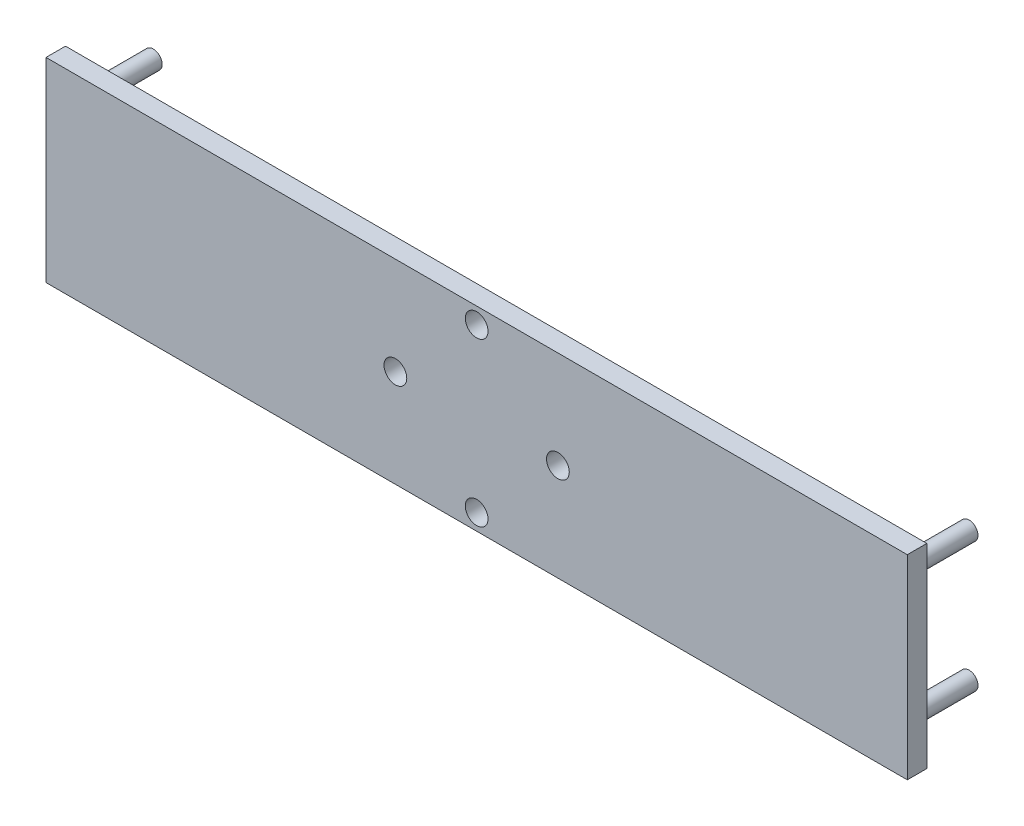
ISO-10303-21;
HEADER;
FILE_DESCRIPTION(('STEP AP214'),'2;1');
FILE_NAME('part.step','',(''),(''),'','','');
FILE_SCHEMA(('AUTOMOTIVE_DESIGN { 1 0 10303 214 1 1 1 1 }'));
ENDSEC;
DATA;
#1=APPLICATION_CONTEXT('core data for automotive mechanical design processes');
#2=APPLICATION_PROTOCOL_DEFINITION('international standard','automotive_design',2000,#1);
#3=PRODUCT_CONTEXT('',#1,'mechanical');
#4=PRODUCT('Part','Part','',(#3));
#5=PRODUCT_RELATED_PRODUCT_CATEGORY('part','',(#4));
#6=PRODUCT_DEFINITION_FORMATION('','',#4);
#7=PRODUCT_DEFINITION_CONTEXT('part definition',#1,'design');
#8=PRODUCT_DEFINITION('design','',#6,#7);
#9=PRODUCT_DEFINITION_SHAPE('','',#8);
#10=(LENGTH_UNIT() NAMED_UNIT(*) SI_UNIT(.MILLI.,.METRE.));
#11=(NAMED_UNIT(*) PLANE_ANGLE_UNIT() SI_UNIT($,.RADIAN.));
#12=(NAMED_UNIT(*) SI_UNIT($,.STERADIAN.) SOLID_ANGLE_UNIT());
#13=UNCERTAINTY_MEASURE_WITH_UNIT(LENGTH_MEASURE(1.E-05),#10,'distance_accuracy_value','');
#14=(GEOMETRIC_REPRESENTATION_CONTEXT(3) GLOBAL_UNCERTAINTY_ASSIGNED_CONTEXT((#13)) GLOBAL_UNIT_ASSIGNED_CONTEXT((#10,
#11,#12)) REPRESENTATION_CONTEXT('',''));
#15=CARTESIAN_POINT('',(0.,0.,0.));
#16=DIRECTION('',(0.,0.,1.));
#17=DIRECTION('',(1.,0.,0.));
#18=AXIS2_PLACEMENT_3D('',#15,#16,#17);
#19=CARTESIAN_POINT('',(132.5,0.,6.));
#20=DIRECTION('',(1.,0.,0.));
#21=DIRECTION('',(0.,0.,-1.));
#22=AXIS2_PLACEMENT_3D('',#19,#20,#21);
#23=PLANE('',#22);
#24=DIRECTION('',(0.,-1.,0.));
#25=VECTOR('',#24,1.);
#26=CARTESIAN_POINT('',(132.5,0.,0.));
#27=LINE('',#26,#25);
#28=CARTESIAN_POINT('',(132.5,30.,0.));
#29=VERTEX_POINT('',#28);
#30=CARTESIAN_POINT('',(132.5,-30.,0.));
#31=VERTEX_POINT('',#30);
#32=EDGE_CURVE('E117',#29,#31,#27,.T.);
#33=ORIENTED_EDGE('',*,*,#32,.F.);
#34=DIRECTION('',(0.,0.,-1.));
#35=VECTOR('',#34,1.);
#36=CARTESIAN_POINT('',(132.5,30.,6.));
#37=LINE('',#36,#35);
#38=CARTESIAN_POINT('',(132.5,30.,6.));
#39=VERTEX_POINT('',#38);
#40=EDGE_CURVE('E76',#39,#29,#37,.T.);
#41=ORIENTED_EDGE('',*,*,#40,.F.);
#42=DIRECTION('',(0.,-1.,0.));
#43=VECTOR('',#42,1.);
#44=CARTESIAN_POINT('',(132.5,0.,6.));
#45=LINE('',#44,#43);
#46=CARTESIAN_POINT('',(132.5,-30.,6.));
#47=VERTEX_POINT('',#46);
#48=EDGE_CURVE('E97',#39,#47,#45,.T.);
#49=ORIENTED_EDGE('',*,*,#48,.T.);
#50=DIRECTION('',(0.,0.,-1.));
#51=VECTOR('',#50,1.);
#52=CARTESIAN_POINT('',(132.5,-30.,6.));
#53=LINE('',#52,#51);
#54=EDGE_CURVE('E73',#47,#31,#53,.T.);
#55=ORIENTED_EDGE('',*,*,#54,.T.);
#56=EDGE_LOOP('',(#33,#41,#49,#55));
#57=FACE_BOUND('',#56,.T.);
#58=ADVANCED_FACE('F32',(#57),#23,.T.);
#59=CARTESIAN_POINT('',(0.,30.,6.));
#60=DIRECTION('',(0.,1.,0.));
#61=DIRECTION('',(0.,0.,1.));
#62=AXIS2_PLACEMENT_3D('',#59,#60,#61);
#63=PLANE('',#62);
#64=DIRECTION('',(1.,0.,0.));
#65=VECTOR('',#64,1.);
#66=CARTESIAN_POINT('',(0.,30.,0.));
#67=LINE('',#66,#65);
#68=CARTESIAN_POINT('',(-132.5,30.,0.));
#69=VERTEX_POINT('',#68);
#70=EDGE_CURVE('E87',#69,#29,#67,.T.);
#71=ORIENTED_EDGE('',*,*,#70,.F.);
#72=DIRECTION('',(0.,0.,-1.));
#73=VECTOR('',#72,1.);
#74=CARTESIAN_POINT('',(-132.5,30.,6.));
#75=LINE('',#74,#73);
#76=CARTESIAN_POINT('',(-132.5,30.,6.));
#77=VERTEX_POINT('',#76);
#78=EDGE_CURVE('E81',#77,#69,#75,.T.);
#79=ORIENTED_EDGE('',*,*,#78,.F.);
#80=DIRECTION('',(1.,0.,0.));
#81=VECTOR('',#80,1.);
#82=CARTESIAN_POINT('',(0.,30.,6.));
#83=LINE('',#82,#81);
#84=EDGE_CURVE('E85',#77,#39,#83,.T.);
#85=ORIENTED_EDGE('',*,*,#84,.T.);
#86=ORIENTED_EDGE('',*,*,#40,.T.);
#87=EDGE_LOOP('',(#71,#79,#85,#86));
#88=FACE_BOUND('',#87,.T.);
#89=ADVANCED_FACE('F83',(#88),#63,.T.);
#90=CARTESIAN_POINT('',(-132.5,0.,6.));
#91=DIRECTION('',(1.,0.,0.));
#92=DIRECTION('',(0.,0.,-1.));
#93=AXIS2_PLACEMENT_3D('',#90,#91,#92);
#94=PLANE('',#93);
#95=DIRECTION('',(0.,-1.,0.));
#96=VECTOR('',#95,1.);
#97=CARTESIAN_POINT('',(-132.5,0.,0.));
#98=LINE('',#97,#96);
#99=CARTESIAN_POINT('',(-132.5,-30.,0.));
#100=VERTEX_POINT('',#99);
#101=EDGE_CURVE('E120',#69,#100,#98,.T.);
#102=ORIENTED_EDGE('',*,*,#101,.T.);
#103=DIRECTION('',(0.,0.,-1.));
#104=VECTOR('',#103,1.);
#105=CARTESIAN_POINT('',(-132.5,-30.,6.));
#106=LINE('',#105,#104);
#107=CARTESIAN_POINT('',(-132.5,-30.,6.));
#108=VERTEX_POINT('',#107);
#109=EDGE_CURVE('E90',#108,#100,#106,.T.);
#110=ORIENTED_EDGE('',*,*,#109,.F.);
#111=DIRECTION('',(0.,-1.,0.));
#112=VECTOR('',#111,1.);
#113=CARTESIAN_POINT('',(-132.5,0.,6.));
#114=LINE('',#113,#112);
#115=EDGE_CURVE('E93',#77,#108,#114,.T.);
#116=ORIENTED_EDGE('',*,*,#115,.F.);
#117=ORIENTED_EDGE('',*,*,#78,.T.);
#118=EDGE_LOOP('',(#102,#110,#116,#117));
#119=FACE_BOUND('',#118,.T.);
#120=ADVANCED_FACE('F94',(#119),#94,.F.);
#121=CARTESIAN_POINT('',(0.,25.,6.));
#122=DIRECTION('',(0.,0.,-1.));
#123=DIRECTION('',(-1.,0.,0.));
#124=AXIS2_PLACEMENT_3D('',#121,#122,#123);
#125=CYLINDRICAL_SURFACE('',#124,3.5);
#126=CARTESIAN_POINT('',(0.,25.,6.));
#127=DIRECTION('',(0.,0.,1.));
#128=DIRECTION('',(1.,0.,0.));
#129=AXIS2_PLACEMENT_3D('',#126,#127,#128);
#130=CIRCLE('',#129,3.5);
#131=CARTESIAN_POINT('',(3.5,25.,6.));
#132=VERTEX_POINT('',#131);
#133=EDGE_CURVE('E99',#132,#132,#130,.T.);
#134=ORIENTED_EDGE('',*,*,#133,.T.);
#135=EDGE_LOOP('',(#134));
#136=FACE_BOUND('',#135,.T.);
#137=CARTESIAN_POINT('',(0.,25.,0.));
#138=DIRECTION('',(0.,0.,1.));
#139=DIRECTION('',(1.,0.,0.));
#140=AXIS2_PLACEMENT_3D('',#137,#138,#139);
#141=CIRCLE('',#140,3.5);
#142=CARTESIAN_POINT('',(3.5,25.,0.));
#143=VERTEX_POINT('',#142);
#144=EDGE_CURVE('E114',#143,#143,#141,.T.);
#145=ORIENTED_EDGE('',*,*,#144,.F.);
#146=EDGE_LOOP('',(#145));
#147=FACE_BOUND('',#146,.T.);
#148=ADVANCED_FACE('F160',(#136,#147),#125,.F.);
#149=CARTESIAN_POINT('',(25.,0.,6.));
#150=DIRECTION('',(0.,0.,-1.));
#151=DIRECTION('',(-1.,0.,0.));
#152=AXIS2_PLACEMENT_3D('',#149,#150,#151);
#153=CYLINDRICAL_SURFACE('',#152,3.5);
#154=CARTESIAN_POINT('',(25.,0.,6.));
#155=DIRECTION('',(0.,0.,1.));
#156=DIRECTION('',(1.,0.,0.));
#157=AXIS2_PLACEMENT_3D('',#154,#155,#156);
#158=CIRCLE('',#157,3.5);
#159=CARTESIAN_POINT('',(28.5,0.,6.));
#160=VERTEX_POINT('',#159);
#161=EDGE_CURVE('E180',#160,#160,#158,.T.);
#162=ORIENTED_EDGE('',*,*,#161,.T.);
#163=EDGE_LOOP('',(#162));
#164=FACE_BOUND('',#163,.T.);
#165=CARTESIAN_POINT('',(25.,0.,0.));
#166=DIRECTION('',(0.,0.,1.));
#167=DIRECTION('',(1.,0.,0.));
#168=AXIS2_PLACEMENT_3D('',#165,#166,#167);
#169=CIRCLE('',#168,3.5);
#170=CARTESIAN_POINT('',(28.5,0.,0.));
#171=VERTEX_POINT('',#170);
#172=EDGE_CURVE('E111',#171,#171,#169,.T.);
#173=ORIENTED_EDGE('',*,*,#172,.F.);
#174=EDGE_LOOP('',(#173));
#175=FACE_BOUND('',#174,.T.);
#176=ADVANCED_FACE('F163',(#164,#175),#153,.F.);
#177=CARTESIAN_POINT('',(-1.74574066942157E-13,-25.,6.));
#178=DIRECTION('',(0.,0.,-1.));
#179=DIRECTION('',(-1.,0.,0.));
#180=AXIS2_PLACEMENT_3D('',#177,#178,#179);
#181=CYLINDRICAL_SURFACE('',#180,3.5);
#182=CARTESIAN_POINT('',(-1.74574066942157E-13,-25.,6.));
#183=DIRECTION('',(0.,0.,1.));
#184=DIRECTION('',(1.,0.,0.));
#185=AXIS2_PLACEMENT_3D('',#182,#183,#184);
#186=CIRCLE('',#185,3.5);
#187=CARTESIAN_POINT('',(3.49999999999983,-25.,6.));
#188=VERTEX_POINT('',#187);
#189=EDGE_CURVE('E178',#188,#188,#186,.T.);
#190=ORIENTED_EDGE('',*,*,#189,.T.);
#191=EDGE_LOOP('',(#190));
#192=FACE_BOUND('',#191,.T.);
#193=CARTESIAN_POINT('',(-1.74574066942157E-13,-25.,0.));
#194=DIRECTION('',(0.,0.,1.));
#195=DIRECTION('',(1.,0.,0.));
#196=AXIS2_PLACEMENT_3D('',#193,#194,#195);
#197=CIRCLE('',#196,3.5);
#198=CARTESIAN_POINT('',(3.49999999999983,-25.,0.));
#199=VERTEX_POINT('',#198);
#200=EDGE_CURVE('E107',#199,#199,#197,.T.);
#201=ORIENTED_EDGE('',*,*,#200,.F.);
#202=EDGE_LOOP('',(#201));
#203=FACE_BOUND('',#202,.T.);
#204=ADVANCED_FACE('F166',(#192,#203),#181,.F.);
#205=CARTESIAN_POINT('',(-25.,2.61861100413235E-13,6.));
#206=DIRECTION('',(0.,0.,-1.));
#207=DIRECTION('',(-1.,0.,0.));
#208=AXIS2_PLACEMENT_3D('',#205,#206,#207);
#209=CYLINDRICAL_SURFACE('',#208,3.5);
#210=CARTESIAN_POINT('',(-25.,2.61861100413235E-13,6.));
#211=DIRECTION('',(0.,0.,1.));
#212=DIRECTION('',(1.,0.,0.));
#213=AXIS2_PLACEMENT_3D('',#210,#211,#212);
#214=CIRCLE('',#213,3.5);
#215=CARTESIAN_POINT('',(-21.5,2.61861100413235E-13,6.));
#216=VERTEX_POINT('',#215);
#217=EDGE_CURVE('E123',#216,#216,#214,.T.);
#218=ORIENTED_EDGE('',*,*,#217,.T.);
#219=EDGE_LOOP('',(#218));
#220=FACE_BOUND('',#219,.T.);
#221=CARTESIAN_POINT('',(-25.,2.61861100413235E-13,0.));
#222=DIRECTION('',(0.,0.,1.));
#223=DIRECTION('',(1.,0.,0.));
#224=AXIS2_PLACEMENT_3D('',#221,#222,#223);
#225=CIRCLE('',#224,3.5);
#226=CARTESIAN_POINT('',(-21.5,2.61861100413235E-13,0.));
#227=VERTEX_POINT('',#226);
#228=EDGE_CURVE('E104',#227,#227,#225,.T.);
#229=ORIENTED_EDGE('',*,*,#228,.F.);
#230=EDGE_LOOP('',(#229));
#231=FACE_BOUND('',#230,.T.);
#232=ADVANCED_FACE('F34',(#220,#231),#209,.F.);
#233=CARTESIAN_POINT('',(0.,-30.,6.));
#234=DIRECTION('',(0.,1.,0.));
#235=DIRECTION('',(0.,0.,1.));
#236=AXIS2_PLACEMENT_3D('',#233,#234,#235);
#237=PLANE('',#236);
#238=DIRECTION('',(1.,0.,0.));
#239=VECTOR('',#238,1.);
#240=CARTESIAN_POINT('',(0.,-30.,0.));
#241=LINE('',#240,#239);
#242=EDGE_CURVE('E66',#100,#31,#241,.T.);
#243=ORIENTED_EDGE('',*,*,#242,.T.);
#244=ORIENTED_EDGE('',*,*,#54,.F.);
#245=DIRECTION('',(1.,0.,0.));
#246=VECTOR('',#245,1.);
#247=CARTESIAN_POINT('',(0.,-30.,6.));
#248=LINE('',#247,#246);
#249=EDGE_CURVE('E49',#108,#47,#248,.T.);
#250=ORIENTED_EDGE('',*,*,#249,.F.);
#251=ORIENTED_EDGE('',*,*,#109,.T.);
#252=EDGE_LOOP('',(#243,#244,#250,#251));
#253=FACE_BOUND('',#252,.T.);
#254=ADVANCED_FACE('F173',(#253),#237,.F.);
#255=CARTESIAN_POINT('',(0.,0.,6.));
#256=DIRECTION('',(0.,0.,1.));
#257=DIRECTION('',(1.,0.,0.));
#258=AXIS2_PLACEMENT_3D('',#255,#256,#257);
#259=PLANE('',#258);
#260=ORIENTED_EDGE('',*,*,#217,.F.);
#261=EDGE_LOOP('',(#260));
#262=FACE_BOUND('',#261,.T.);
#263=ORIENTED_EDGE('',*,*,#189,.F.);
#264=EDGE_LOOP('',(#263));
#265=FACE_BOUND('',#264,.T.);
#266=ORIENTED_EDGE('',*,*,#161,.F.);
#267=EDGE_LOOP('',(#266));
#268=FACE_BOUND('',#267,.T.);
#269=ORIENTED_EDGE('',*,*,#133,.F.);
#270=EDGE_LOOP('',(#269));
#271=FACE_BOUND('',#270,.T.);
#272=ORIENTED_EDGE('',*,*,#48,.F.);
#273=ORIENTED_EDGE('',*,*,#84,.F.);
#274=ORIENTED_EDGE('',*,*,#115,.T.);
#275=ORIENTED_EDGE('',*,*,#249,.T.);
#276=EDGE_LOOP('',(#272,#273,#274,#275));
#277=FACE_BOUND('',#276,.T.);
#278=ADVANCED_FACE('F96',(#262,#265,#268,#271,#277),#259,.T.);
#279=CARTESIAN_POINT('',(0.,0.,0.));
#280=DIRECTION('',(0.,0.,1.));
#281=DIRECTION('',(1.,0.,0.));
#282=AXIS2_PLACEMENT_3D('',#279,#280,#281);
#283=PLANE('',#282);
#284=CARTESIAN_POINT('',(-125.5,-20.,0.));
#285=DIRECTION('',(0.,0.,1.));
#286=DIRECTION('',(1.,0.,0.));
#287=AXIS2_PLACEMENT_3D('',#284,#285,#286);
#288=CIRCLE('',#287,2.75000000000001);
#289=CARTESIAN_POINT('',(-122.75,-20.,0.));
#290=VERTEX_POINT('',#289);
#291=EDGE_CURVE('E11',#290,#290,#288,.F.);
#292=ORIENTED_EDGE('',*,*,#291,.F.);
#293=EDGE_LOOP('',(#292));
#294=FACE_BOUND('',#293,.T.);
#295=CARTESIAN_POINT('',(125.5,20.0000000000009,0.));
#296=DIRECTION('',(0.,0.,1.));
#297=DIRECTION('',(1.,0.,0.));
#298=AXIS2_PLACEMENT_3D('',#295,#296,#297);
#299=CIRCLE('',#298,2.75000000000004);
#300=CARTESIAN_POINT('',(128.25,20.0000000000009,0.));
#301=VERTEX_POINT('',#300);
#302=EDGE_CURVE('E41',#301,#301,#299,.F.);
#303=ORIENTED_EDGE('',*,*,#302,.F.);
#304=EDGE_LOOP('',(#303));
#305=FACE_BOUND('',#304,.T.);
#306=CARTESIAN_POINT('',(-125.5,20.,0.));
#307=DIRECTION('',(0.,0.,1.));
#308=DIRECTION('',(1.,0.,0.));
#309=AXIS2_PLACEMENT_3D('',#306,#307,#308);
#310=CIRCLE('',#309,2.75000000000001);
#311=CARTESIAN_POINT('',(-122.75,20.,0.));
#312=VERTEX_POINT('',#311);
#313=EDGE_CURVE('E140',#312,#312,#310,.T.);
#314=ORIENTED_EDGE('',*,*,#313,.T.);
#315=EDGE_LOOP('',(#314));
#316=FACE_BOUND('',#315,.T.);
#317=CARTESIAN_POINT('',(125.5,-19.9999999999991,0.));
#318=DIRECTION('',(0.,0.,1.));
#319=DIRECTION('',(1.,0.,0.));
#320=AXIS2_PLACEMENT_3D('',#317,#318,#319);
#321=CIRCLE('',#320,2.75000000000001);
#322=CARTESIAN_POINT('',(128.25,-19.9999999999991,0.));
#323=VERTEX_POINT('',#322);
#324=EDGE_CURVE('E144',#323,#323,#321,.T.);
#325=ORIENTED_EDGE('',*,*,#324,.T.);
#326=EDGE_LOOP('',(#325));
#327=FACE_BOUND('',#326,.T.);
#328=ORIENTED_EDGE('',*,*,#228,.T.);
#329=EDGE_LOOP('',(#328));
#330=FACE_BOUND('',#329,.T.);
#331=ORIENTED_EDGE('',*,*,#200,.T.);
#332=EDGE_LOOP('',(#331));
#333=FACE_BOUND('',#332,.T.);
#334=ORIENTED_EDGE('',*,*,#172,.T.);
#335=EDGE_LOOP('',(#334));
#336=FACE_BOUND('',#335,.T.);
#337=ORIENTED_EDGE('',*,*,#144,.T.);
#338=EDGE_LOOP('',(#337));
#339=FACE_BOUND('',#338,.T.);
#340=ORIENTED_EDGE('',*,*,#32,.T.);
#341=ORIENTED_EDGE('',*,*,#242,.F.);
#342=ORIENTED_EDGE('',*,*,#101,.F.);
#343=ORIENTED_EDGE('',*,*,#70,.T.);
#344=EDGE_LOOP('',(#340,#341,#342,#343));
#345=FACE_BOUND('',#344,.T.);
#346=ADVANCED_FACE('F131',(#294,#305,#316,#327,#330,#333,#336,#339,#345),#283,.F.);
#347=CARTESIAN_POINT('',(125.5,-19.9999999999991,-20.));
#348=DIRECTION('',(0.,0.,1.));
#349=DIRECTION('',(1.,0.,0.));
#350=AXIS2_PLACEMENT_3D('',#347,#348,#349);
#351=CYLINDRICAL_SURFACE('',#350,2.75000000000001);
#352=CARTESIAN_POINT('',(125.5,-19.9999999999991,-20.));
#353=DIRECTION('',(0.,0.,1.));
#354=DIRECTION('',(1.,0.,0.));
#355=AXIS2_PLACEMENT_3D('',#352,#353,#354);
#356=CIRCLE('',#355,2.75000000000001);
#357=CARTESIAN_POINT('',(128.25,-19.9999999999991,-20.));
#358=VERTEX_POINT('',#357);
#359=EDGE_CURVE('E108',#358,#358,#356,.T.);
#360=ORIENTED_EDGE('',*,*,#359,.T.);
#361=EDGE_LOOP('',(#360));
#362=FACE_BOUND('',#361,.T.);
#363=ORIENTED_EDGE('',*,*,#324,.F.);
#364=EDGE_LOOP('',(#363));
#365=FACE_BOUND('',#364,.T.);
#366=ADVANCED_FACE('F134',(#362,#365),#351,.T.);
#367=CARTESIAN_POINT('',(125.5,-19.9999999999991,-20.));
#368=DIRECTION('',(0.,0.,1.));
#369=DIRECTION('',(1.,0.,0.));
#370=AXIS2_PLACEMENT_3D('',#367,#368,#369);
#371=PLANE('',#370);
#372=ORIENTED_EDGE('',*,*,#359,.F.);
#373=EDGE_LOOP('',(#372));
#374=FACE_BOUND('',#373,.T.);
#375=ADVANCED_FACE('F250',(#374),#371,.F.);
#376=CARTESIAN_POINT('',(-125.5,20.,-20.));
#377=DIRECTION('',(0.,0.,1.));
#378=DIRECTION('',(1.,0.,0.));
#379=AXIS2_PLACEMENT_3D('',#376,#377,#378);
#380=CYLINDRICAL_SURFACE('',#379,2.75000000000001);
#381=CARTESIAN_POINT('',(-125.5,20.,-20.));
#382=DIRECTION('',(0.,0.,1.));
#383=DIRECTION('',(1.,0.,0.));
#384=AXIS2_PLACEMENT_3D('',#381,#382,#383);
#385=CIRCLE('',#384,2.75000000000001);
#386=CARTESIAN_POINT('',(-122.75,20.,-20.));
#387=VERTEX_POINT('',#386);
#388=EDGE_CURVE('E327',#387,#387,#385,.T.);
#389=ORIENTED_EDGE('',*,*,#388,.T.);
#390=EDGE_LOOP('',(#389));
#391=FACE_BOUND('',#390,.T.);
#392=ORIENTED_EDGE('',*,*,#313,.F.);
#393=EDGE_LOOP('',(#392));
#394=FACE_BOUND('',#393,.T.);
#395=ADVANCED_FACE('F259',(#391,#394),#380,.T.);
#396=CARTESIAN_POINT('',(-125.5,20.,-20.));
#397=DIRECTION('',(0.,0.,1.));
#398=DIRECTION('',(1.,0.,0.));
#399=AXIS2_PLACEMENT_3D('',#396,#397,#398);
#400=PLANE('',#399);
#401=ORIENTED_EDGE('',*,*,#388,.F.);
#402=EDGE_LOOP('',(#401));
#403=FACE_BOUND('',#402,.T.);
#404=ADVANCED_FACE('F268',(#403),#400,.F.);
#405=CARTESIAN_POINT('',(125.5,20.0000000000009,-20.));
#406=DIRECTION('',(0.,0.,1.));
#407=DIRECTION('',(1.,0.,0.));
#408=AXIS2_PLACEMENT_3D('',#405,#406,#407);
#409=CYLINDRICAL_SURFACE('',#408,2.75000000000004);
#410=CARTESIAN_POINT('',(125.5,20.0000000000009,-20.));
#411=DIRECTION('',(0.,0.,-1.));
#412=DIRECTION('',(-1.,0.,0.));
#413=AXIS2_PLACEMENT_3D('',#410,#411,#412);
#414=CIRCLE('',#413,2.75000000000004);
#415=CARTESIAN_POINT('',(122.75,20.0000000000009,-20.));
#416=VERTEX_POINT('',#415);
#417=EDGE_CURVE('E324',#416,#416,#414,.T.);
#418=ORIENTED_EDGE('',*,*,#417,.F.);
#419=EDGE_LOOP('',(#418));
#420=FACE_BOUND('',#419,.T.);
#421=ORIENTED_EDGE('',*,*,#302,.T.);
#422=EDGE_LOOP('',(#421));
#423=FACE_BOUND('',#422,.T.);
#424=ADVANCED_FACE('F129',(#420,#423),#409,.T.);
#425=CARTESIAN_POINT('',(125.5,20.0000000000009,-20.));
#426=DIRECTION('',(0.,0.,-1.));
#427=DIRECTION('',(-1.,0.,0.));
#428=AXIS2_PLACEMENT_3D('',#425,#426,#427);
#429=PLANE('',#428);
#430=ORIENTED_EDGE('',*,*,#417,.T.);
#431=EDGE_LOOP('',(#430));
#432=FACE_BOUND('',#431,.T.);
#433=ADVANCED_FACE('F287',(#432),#429,.T.);
#434=CARTESIAN_POINT('',(-125.5,-20.,-20.));
#435=DIRECTION('',(0.,0.,1.));
#436=DIRECTION('',(1.,0.,0.));
#437=AXIS2_PLACEMENT_3D('',#434,#435,#436);
#438=CYLINDRICAL_SURFACE('',#437,2.75000000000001);
#439=CARTESIAN_POINT('',(-125.5,-20.,-20.));
#440=DIRECTION('',(0.,0.,-1.));
#441=DIRECTION('',(-1.,0.,0.));
#442=AXIS2_PLACEMENT_3D('',#439,#440,#441);
#443=CIRCLE('',#442,2.75000000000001);
#444=CARTESIAN_POINT('',(-128.25,-20.,-20.));
#445=VERTEX_POINT('',#444);
#446=EDGE_CURVE('E323',#445,#445,#443,.T.);
#447=ORIENTED_EDGE('',*,*,#446,.F.);
#448=EDGE_LOOP('',(#447));
#449=FACE_BOUND('',#448,.T.);
#450=ORIENTED_EDGE('',*,*,#291,.T.);
#451=EDGE_LOOP('',(#450));
#452=FACE_BOUND('',#451,.T.);
#453=ADVANCED_FACE('F297',(#449,#452),#438,.T.);
#454=CARTESIAN_POINT('',(-125.5,-20.,-20.));
#455=DIRECTION('',(0.,0.,-1.));
#456=DIRECTION('',(-1.,0.,0.));
#457=AXIS2_PLACEMENT_3D('',#454,#455,#456);
#458=PLANE('',#457);
#459=ORIENTED_EDGE('',*,*,#446,.T.);
#460=EDGE_LOOP('',(#459));
#461=FACE_BOUND('',#460,.T.);
#462=ADVANCED_FACE('F307',(#461),#458,.T.);
#463=CLOSED_SHELL('',(#58,#89,#120,#148,#176,#204,#232,#254,#278,#346,#366,#375,#395,#404,#424,
#433,#453,#462));
#464=MANIFOLD_SOLID_BREP('B2',#463);
#465=ADVANCED_BREP_SHAPE_REPRESENTATION('',(#18,#464),#14);
#466=SHAPE_DEFINITION_REPRESENTATION(#9,#465);
ENDSEC;
END-ISO-10303-21;
